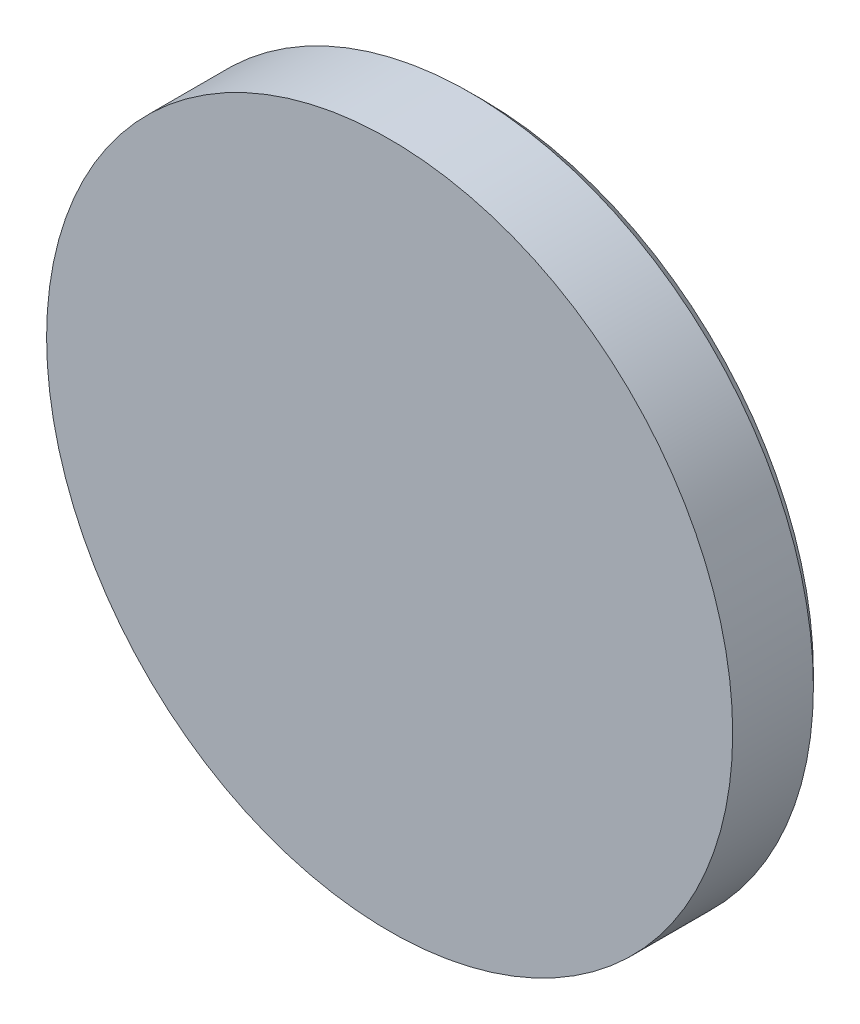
from build123d import *

# Parameters (mm, degrees)
ESQUISSE1_R         = 85
BRUT_DEPTH          = 25
ESQUISSE2_OUTSIDE_W = 220.342
ESQUISSE2_OUTSIDE_H = 220.342
ESQUISSE2_OUTSIDE_R = 74
DRESSAGE_DEPTH      = 2
CHANFREIN_SIZE      = 3


with BuildPart() as part:
    # Esquisse1 → Brut (new body)
    with BuildSketch(Plane.XY):
        Circle(ESQUISSE1_R)
    extrude(amount=BRUT_DEPTH)

    # Esquisse2 outside → Dressage (cut)
    with BuildSketch(Plane(origin=(0, 0, 0), x_dir=(-1, 0, 0), z_dir=(0, 0, -1))):
        Rectangle(ESQUISSE2_OUTSIDE_W, ESQUISSE2_OUTSIDE_H)
        Circle(ESQUISSE2_OUTSIDE_R, mode=Mode.SUBTRACT)
    extrude(amount=-DRESSAGE_DEPTH, mode=Mode.SUBTRACT)

    # Chanfrein
    chanfrein_edges = [part.edges().sort_by_distance(p)[0] for p in [
        (-85, 0, 2),
    ]]
    chamfer(chanfrein_edges, length=CHANFREIN_SIZE)


solid = part.part
